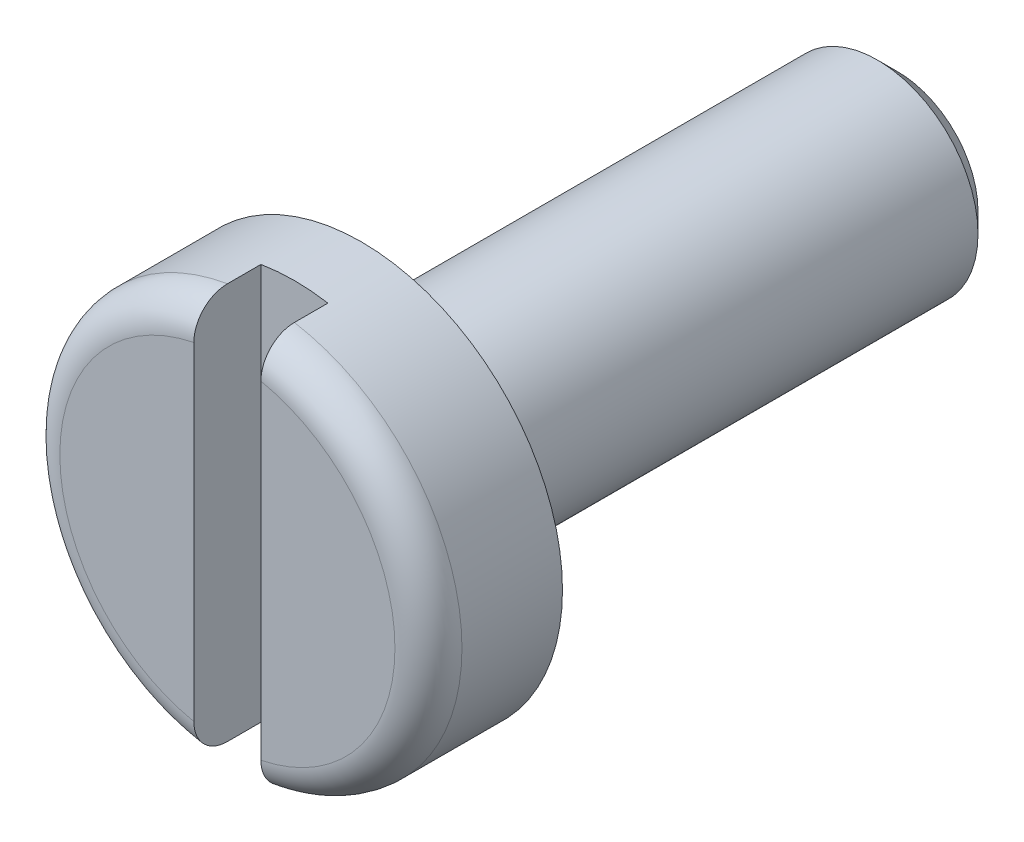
from build123d import *

# Parameters (mm, degrees)
ESQUISSE1_R             = 1.5
EXTRUSION1_DEPTH        = 8
ESQUISSE2_R             = 3
EXTRUSION2_DEPTH        = 2
CONG_1_R                = 0.5
CHANFREIN1_SIZE         = 0.3
ESQUISSE3_W             = 1
ESQUISSE3_H             = 6.610384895
ENL_V_MAT_EXTRU_1_DEPTH = 1


with BuildPart() as part:
    # Esquisse1 → Extrusion1 (new body)
    with BuildSketch(Plane.XY):
        Circle(ESQUISSE1_R)
    extrude(amount=EXTRUSION1_DEPTH)

    # Esquisse2 → Extrusion2 (add)
    with BuildSketch(Plane.XY.offset(8)):
        Circle(ESQUISSE2_R)
    extrude(amount=EXTRUSION2_DEPTH)

    # Cong_1
    cong_1_edges = [part.edges().sort_by_distance(p)[0] for p in [
        (-3, 0, 10),
    ]]
    fillet(cong_1_edges, radius=CONG_1_R)

    # Chanfrein1
    chanfrein1_edges = [part.edges().sort_by_distance(p)[0] for p in [
        (-1.5, 0, 0),
    ]]
    chamfer(chanfrein1_edges, length=CHANFREIN1_SIZE)

    # Esquisse3 → Enl_v. mat.-Extru.1 (cut)
    with BuildSketch(Plane.XY.offset(10)):
        with Locations((0, -0.076555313)):
            Rectangle(ESQUISSE3_W, ESQUISSE3_H)
    extrude(amount=-ENL_V_MAT_EXTRU_1_DEPTH, mode=Mode.SUBTRACT)


solid = part.part
